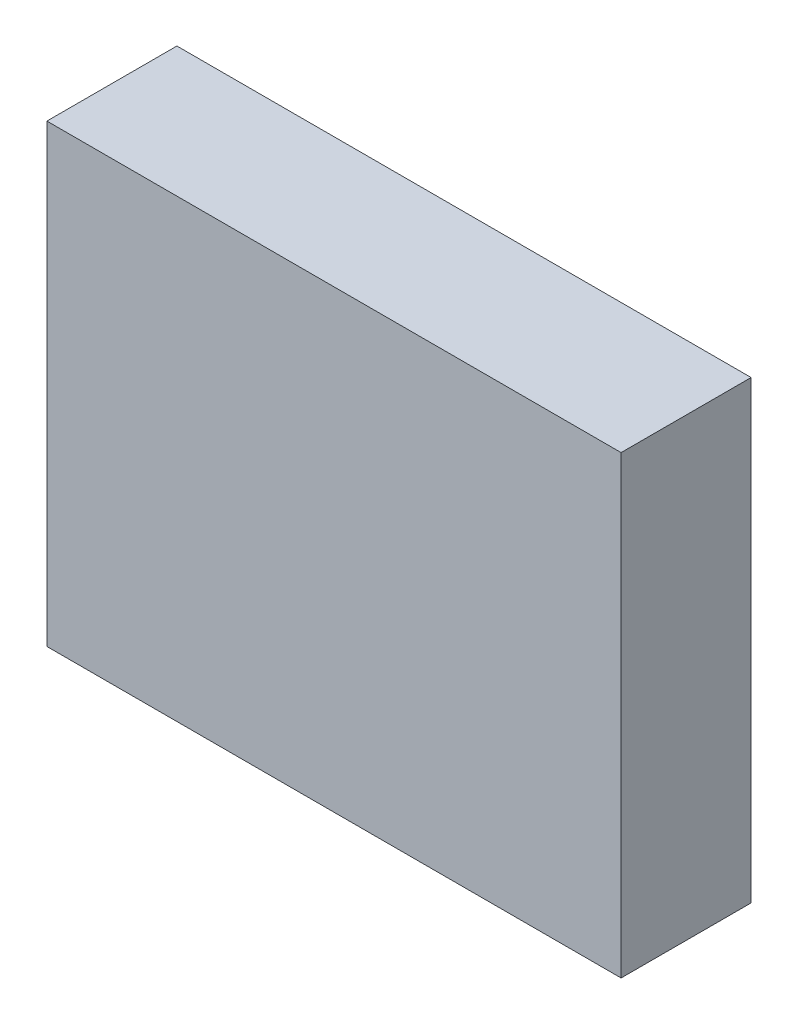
ISO-10303-21;
HEADER;
FILE_DESCRIPTION(('STEP AP214'),'2;1');
FILE_NAME('part.step','',(''),(''),'','','');
FILE_SCHEMA(('AUTOMOTIVE_DESIGN { 1 0 10303 214 1 1 1 1 }'));
ENDSEC;
DATA;
#1=APPLICATION_CONTEXT('core data for automotive mechanical design processes');
#2=APPLICATION_PROTOCOL_DEFINITION('international standard','automotive_design',2000,#1);
#3=PRODUCT_CONTEXT('',#1,'mechanical');
#4=PRODUCT('Part','Part','',(#3));
#5=PRODUCT_RELATED_PRODUCT_CATEGORY('part','',(#4));
#6=PRODUCT_DEFINITION_FORMATION('','',#4);
#7=PRODUCT_DEFINITION_CONTEXT('part definition',#1,'design');
#8=PRODUCT_DEFINITION('design','',#6,#7);
#9=PRODUCT_DEFINITION_SHAPE('','',#8);
#10=(LENGTH_UNIT() NAMED_UNIT(*) SI_UNIT(.MILLI.,.METRE.));
#11=(NAMED_UNIT(*) PLANE_ANGLE_UNIT() SI_UNIT($,.RADIAN.));
#12=(NAMED_UNIT(*) SI_UNIT($,.STERADIAN.) SOLID_ANGLE_UNIT());
#13=UNCERTAINTY_MEASURE_WITH_UNIT(LENGTH_MEASURE(1.E-05),#10,'distance_accuracy_value','');
#14=(GEOMETRIC_REPRESENTATION_CONTEXT(3) GLOBAL_UNCERTAINTY_ASSIGNED_CONTEXT((#13)) GLOBAL_UNIT_ASSIGNED_CONTEXT((#10,
#11,#12)) REPRESENTATION_CONTEXT('',''));
#15=CARTESIAN_POINT('',(0.,0.,0.));
#16=DIRECTION('',(0.,0.,1.));
#17=DIRECTION('',(1.,0.,0.));
#18=AXIS2_PLACEMENT_3D('',#15,#16,#17);
#19=CARTESIAN_POINT('',(-62.0515463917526,29.7680412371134,24.));
#20=DIRECTION('',(1.,0.,0.));
#21=DIRECTION('',(0.,1.,0.));
#22=AXIS2_PLACEMENT_3D('',#19,#20,#21);
#23=PLANE('',#22);
#24=DIRECTION('',(0.,-1.,0.));
#25=VECTOR('',#24,1.);
#26=CARTESIAN_POINT('',(-62.0515463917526,29.7680412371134,0.));
#27=LINE('',#26,#25);
#28=CARTESIAN_POINT('',(-62.0515463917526,29.7680412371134,0.));
#29=VERTEX_POINT('',#28);
#30=CARTESIAN_POINT('',(-62.0515463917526,-54.2319587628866,0.));
#31=VERTEX_POINT('',#30);
#32=EDGE_CURVE('E96',#29,#31,#27,.T.);
#33=ORIENTED_EDGE('',*,*,#32,.T.);
#34=DIRECTION('',(0.,0.,-1.));
#35=VECTOR('',#34,1.);
#36=CARTESIAN_POINT('',(-62.0515463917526,-54.2319587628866,24.));
#37=LINE('',#36,#35);
#38=CARTESIAN_POINT('',(-62.0515463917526,-54.2319587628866,24.));
#39=VERTEX_POINT('',#38);
#40=EDGE_CURVE('E11',#39,#31,#37,.T.);
#41=ORIENTED_EDGE('',*,*,#40,.F.);
#42=DIRECTION('',(0.,-1.,0.));
#43=VECTOR('',#42,1.);
#44=CARTESIAN_POINT('',(-62.0515463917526,29.7680412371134,24.));
#45=LINE('',#44,#43);
#46=CARTESIAN_POINT('',(-62.0515463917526,29.7680412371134,24.));
#47=VERTEX_POINT('',#46);
#48=EDGE_CURVE('E84',#47,#39,#45,.T.);
#49=ORIENTED_EDGE('',*,*,#48,.F.);
#50=DIRECTION('',(0.,0.,-1.));
#51=VECTOR('',#50,1.);
#52=CARTESIAN_POINT('',(-62.0515463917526,29.7680412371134,24.));
#53=LINE('',#52,#51);
#54=EDGE_CURVE('E92',#47,#29,#53,.T.);
#55=ORIENTED_EDGE('',*,*,#54,.T.);
#56=EDGE_LOOP('',(#33,#41,#49,#55));
#57=FACE_BOUND('',#56,.T.);
#58=ADVANCED_FACE('F33',(#57),#23,.F.);
#59=CARTESIAN_POINT('',(-62.0515463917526,-54.2319587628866,24.));
#60=DIRECTION('',(0.,1.,0.));
#61=DIRECTION('',(0.,0.,1.));
#62=AXIS2_PLACEMENT_3D('',#59,#60,#61);
#63=PLANE('',#62);
#64=DIRECTION('',(1.,0.,0.));
#65=VECTOR('',#64,1.);
#66=CARTESIAN_POINT('',(-62.0515463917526,-54.2319587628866,0.));
#67=LINE('',#66,#65);
#68=CARTESIAN_POINT('',(43.9484536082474,-54.2319587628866,0.));
#69=VERTEX_POINT('',#68);
#70=EDGE_CURVE('E88',#31,#69,#67,.T.);
#71=ORIENTED_EDGE('',*,*,#70,.T.);
#72=DIRECTION('',(0.,0.,-1.));
#73=VECTOR('',#72,1.);
#74=CARTESIAN_POINT('',(43.9484536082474,-54.2319587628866,24.));
#75=LINE('',#74,#73);
#76=CARTESIAN_POINT('',(43.9484536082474,-54.2319587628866,24.));
#77=VERTEX_POINT('',#76);
#78=EDGE_CURVE('E41',#77,#69,#75,.T.);
#79=ORIENTED_EDGE('',*,*,#78,.F.);
#80=DIRECTION('',(1.,0.,0.));
#81=VECTOR('',#80,1.);
#82=CARTESIAN_POINT('',(-62.0515463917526,-54.2319587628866,24.));
#83=LINE('',#82,#81);
#84=EDGE_CURVE('E79',#39,#77,#83,.T.);
#85=ORIENTED_EDGE('',*,*,#84,.F.);
#86=ORIENTED_EDGE('',*,*,#40,.T.);
#87=EDGE_LOOP('',(#71,#79,#85,#86));
#88=FACE_BOUND('',#87,.T.);
#89=ADVANCED_FACE('F87',(#88),#63,.F.);
#90=CARTESIAN_POINT('',(43.9484536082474,29.7680412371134,24.));
#91=DIRECTION('',(-1.,0.,0.));
#92=DIRECTION('',(0.,-1.,0.));
#93=AXIS2_PLACEMENT_3D('',#90,#91,#92);
#94=PLANE('',#93);
#95=DIRECTION('',(0.,1.,0.));
#96=VECTOR('',#95,1.);
#97=CARTESIAN_POINT('',(43.9484536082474,29.7680412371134,0.));
#98=LINE('',#97,#96);
#99=CARTESIAN_POINT('',(43.9484536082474,29.7680412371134,0.));
#100=VERTEX_POINT('',#99);
#101=EDGE_CURVE('E66',#69,#100,#98,.T.);
#102=ORIENTED_EDGE('',*,*,#101,.T.);
#103=DIRECTION('',(0.,0.,-1.));
#104=VECTOR('',#103,1.);
#105=CARTESIAN_POINT('',(43.9484536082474,29.7680412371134,24.));
#106=LINE('',#105,#104);
#107=CARTESIAN_POINT('',(43.9484536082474,29.7680412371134,24.));
#108=VERTEX_POINT('',#107);
#109=EDGE_CURVE('E89',#108,#100,#106,.T.);
#110=ORIENTED_EDGE('',*,*,#109,.F.);
#111=DIRECTION('',(0.,1.,0.));
#112=VECTOR('',#111,1.);
#113=CARTESIAN_POINT('',(43.9484536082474,29.7680412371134,24.));
#114=LINE('',#113,#112);
#115=EDGE_CURVE('E82',#77,#108,#114,.T.);
#116=ORIENTED_EDGE('',*,*,#115,.F.);
#117=ORIENTED_EDGE('',*,*,#78,.T.);
#118=EDGE_LOOP('',(#102,#110,#116,#117));
#119=FACE_BOUND('',#118,.T.);
#120=ADVANCED_FACE('F90',(#119),#94,.F.);
#121=CARTESIAN_POINT('',(-62.0515463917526,29.7680412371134,24.));
#122=DIRECTION('',(0.,-1.,0.));
#123=DIRECTION('',(0.,0.,-1.));
#124=AXIS2_PLACEMENT_3D('',#121,#122,#123);
#125=PLANE('',#124);
#126=DIRECTION('',(-1.,0.,0.));
#127=VECTOR('',#126,1.);
#128=CARTESIAN_POINT('',(-62.0515463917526,29.7680412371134,0.));
#129=LINE('',#128,#127);
#130=EDGE_CURVE('E72',#100,#29,#129,.T.);
#131=ORIENTED_EDGE('',*,*,#130,.T.);
#132=ORIENTED_EDGE('',*,*,#54,.F.);
#133=DIRECTION('',(-1.,0.,0.));
#134=VECTOR('',#133,1.);
#135=CARTESIAN_POINT('',(-62.0515463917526,29.7680412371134,24.));
#136=LINE('',#135,#134);
#137=EDGE_CURVE('E49',#108,#47,#136,.T.);
#138=ORIENTED_EDGE('',*,*,#137,.F.);
#139=ORIENTED_EDGE('',*,*,#109,.T.);
#140=EDGE_LOOP('',(#131,#132,#138,#139));
#141=FACE_BOUND('',#140,.T.);
#142=ADVANCED_FACE('F103',(#141),#125,.F.);
#143=CARTESIAN_POINT('',(0.,0.,24.));
#144=DIRECTION('',(0.,0.,1.));
#145=DIRECTION('',(1.,0.,0.));
#146=AXIS2_PLACEMENT_3D('',#143,#144,#145);
#147=PLANE('',#146);
#148=ORIENTED_EDGE('',*,*,#48,.T.);
#149=ORIENTED_EDGE('',*,*,#84,.T.);
#150=ORIENTED_EDGE('',*,*,#115,.T.);
#151=ORIENTED_EDGE('',*,*,#137,.T.);
#152=EDGE_LOOP('',(#148,#149,#150,#151));
#153=FACE_BOUND('',#152,.T.);
#154=ADVANCED_FACE('F80',(#153),#147,.T.);
#155=CARTESIAN_POINT('',(0.,0.,0.));
#156=DIRECTION('',(0.,0.,1.));
#157=DIRECTION('',(1.,0.,0.));
#158=AXIS2_PLACEMENT_3D('',#155,#156,#157);
#159=PLANE('',#158);
#160=ORIENTED_EDGE('',*,*,#32,.F.);
#161=ORIENTED_EDGE('',*,*,#130,.F.);
#162=ORIENTED_EDGE('',*,*,#101,.F.);
#163=ORIENTED_EDGE('',*,*,#70,.F.);
#164=EDGE_LOOP('',(#160,#161,#162,#163));
#165=FACE_BOUND('',#164,.T.);
#166=ADVANCED_FACE('F106',(#165),#159,.F.);
#167=CLOSED_SHELL('',(#58,#89,#120,#142,#154,#166));
#168=MANIFOLD_SOLID_BREP('B2',#167);
#169=ADVANCED_BREP_SHAPE_REPRESENTATION('',(#18,#168),#14);
#170=SHAPE_DEFINITION_REPRESENTATION(#9,#169);
ENDSEC;
END-ISO-10303-21;
